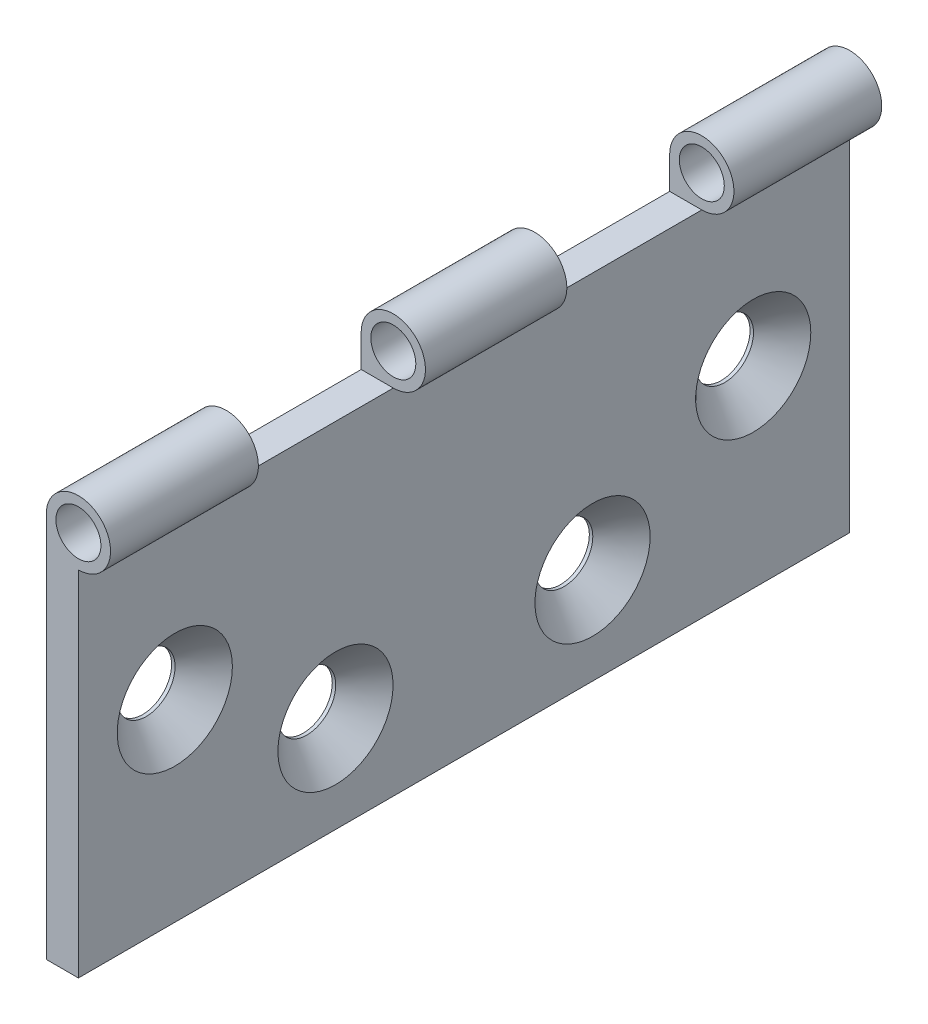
ISO-10303-21;
HEADER;
FILE_DESCRIPTION(('STEP AP214'),'2;1');
FILE_NAME('part.step','',(''),(''),'','','');
FILE_SCHEMA(('AUTOMOTIVE_DESIGN { 1 0 10303 214 1 1 1 1 }'));
ENDSEC;
DATA;
#1=APPLICATION_CONTEXT('core data for automotive mechanical design processes');
#2=APPLICATION_PROTOCOL_DEFINITION('international standard','automotive_design',2000,#1);
#3=PRODUCT_CONTEXT('',#1,'mechanical');
#4=PRODUCT('Part','Part','',(#3));
#5=PRODUCT_RELATED_PRODUCT_CATEGORY('part','',(#4));
#6=PRODUCT_DEFINITION_FORMATION('','',#4);
#7=PRODUCT_DEFINITION_CONTEXT('part definition',#1,'design');
#8=PRODUCT_DEFINITION('design','',#6,#7);
#9=PRODUCT_DEFINITION_SHAPE('','',#8);
#10=(LENGTH_UNIT() NAMED_UNIT(*) SI_UNIT(.MILLI.,.METRE.));
#11=(NAMED_UNIT(*) PLANE_ANGLE_UNIT() SI_UNIT($,.RADIAN.));
#12=(NAMED_UNIT(*) SI_UNIT($,.STERADIAN.) SOLID_ANGLE_UNIT());
#13=UNCERTAINTY_MEASURE_WITH_UNIT(LENGTH_MEASURE(1.E-05),#10,'distance_accuracy_value','');
#14=(GEOMETRIC_REPRESENTATION_CONTEXT(3) GLOBAL_UNCERTAINTY_ASSIGNED_CONTEXT((#13)) GLOBAL_UNIT_ASSIGNED_CONTEXT((#10,
#11,#12)) REPRESENTATION_CONTEXT('',''));
#15=CARTESIAN_POINT('',(0.,0.,0.));
#16=DIRECTION('',(0.,0.,1.));
#17=DIRECTION('',(1.,0.,0.));
#18=AXIS2_PLACEMENT_3D('',#15,#16,#17);
#19=CARTESIAN_POINT('',(0.,0.,60.));
#20=DIRECTION('',(-1.,0.,0.));
#21=DIRECTION('',(0.,-1.,0.));
#22=AXIS2_PLACEMENT_3D('',#19,#20,#21);
#23=PLANE('',#22);
#24=CARTESIAN_POINT('',(-3.13117587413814E-13,30.,-45.));
#25=DIRECTION('',(1.,0.,0.));
#26=DIRECTION('',(0.,0.,-1.));
#27=AXIS2_PLACEMENT_3D('',#24,#25,#26);
#28=CIRCLE('',#27,4.5);
#29=CARTESIAN_POINT('',(-3.13117587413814E-13,30.,-49.5));
#30=VERTEX_POINT('',#29);
#31=EDGE_CURVE('E159',#30,#30,#28,.T.);
#32=ORIENTED_EDGE('',*,*,#31,.T.);
#33=EDGE_LOOP('',(#32));
#34=FACE_BOUND('',#33,.T.);
#35=CARTESIAN_POINT('',(-2.60208521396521E-13,15.,-20.));
#36=DIRECTION('',(1.,0.,0.));
#37=DIRECTION('',(0.,0.,-1.));
#38=AXIS2_PLACEMENT_3D('',#35,#36,#37);
#39=CIRCLE('',#38,4.5);
#40=CARTESIAN_POINT('',(-2.60208521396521E-13,15.,-24.5));
#41=VERTEX_POINT('',#40);
#42=EDGE_CURVE('E168',#41,#41,#39,.T.);
#43=ORIENTED_EDGE('',*,*,#42,.T.);
#44=EDGE_LOOP('',(#43));
#45=FACE_BOUND('',#44,.T.);
#46=CARTESIAN_POINT('',(-3.13117587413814E-13,30.,45.));
#47=DIRECTION('',(1.,0.,0.));
#48=DIRECTION('',(0.,0.,-1.));
#49=AXIS2_PLACEMENT_3D('',#46,#47,#48);
#50=CIRCLE('',#49,4.5);
#51=CARTESIAN_POINT('',(-3.13117587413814E-13,30.,40.5));
#52=VERTEX_POINT('',#51);
#53=EDGE_CURVE('E177',#52,#52,#50,.T.);
#54=ORIENTED_EDGE('',*,*,#53,.T.);
#55=EDGE_LOOP('',(#54));
#56=FACE_BOUND('',#55,.T.);
#57=CARTESIAN_POINT('',(-2.60208521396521E-13,15.,20.));
#58=DIRECTION('',(1.,0.,0.));
#59=DIRECTION('',(0.,0.,-1.));
#60=AXIS2_PLACEMENT_3D('',#57,#58,#59);
#61=CIRCLE('',#60,4.5);
#62=CARTESIAN_POINT('',(-2.60208521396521E-13,15.,15.5));
#63=VERTEX_POINT('',#62);
#64=EDGE_CURVE('E186',#63,#63,#61,.T.);
#65=ORIENTED_EDGE('',*,*,#64,.T.);
#66=EDGE_LOOP('',(#65));
#67=FACE_BOUND('',#66,.T.);
#68=DIRECTION('',(0.,0.,1.));
#69=VECTOR('',#68,1.);
#70=CARTESIAN_POINT('',(-5.04804531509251E-13,55.,0.));
#71=LINE('',#70,#69);
#72=CARTESIAN_POINT('',(-5.04804531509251E-13,55.,-37.));
#73=VERTEX_POINT('',#72);
#74=CARTESIAN_POINT('',(-5.04804531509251E-13,55.,-11.));
#75=VERTEX_POINT('',#74);
#76=EDGE_CURVE('E244',#73,#75,#71,.T.);
#77=ORIENTED_EDGE('',*,*,#76,.F.);
#78=DIRECTION('',(0.,-1.,0.));
#79=VECTOR('',#78,1.);
#80=CARTESIAN_POINT('',(-3.12250225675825E-13,0.,-37.));
#81=LINE('',#80,#79);
#82=CARTESIAN_POINT('',(-5.21842550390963E-13,60.,-37.));
#83=VERTEX_POINT('',#82);
#84=EDGE_CURVE('E127',#83,#73,#81,.T.);
#85=ORIENTED_EDGE('',*,*,#84,.F.);
#86=DIRECTION('',(0.,0.,-1.));
#87=VECTOR('',#86,1.);
#88=CARTESIAN_POINT('',(-2.09419661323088E-13,60.,60.));
#89=LINE('',#88,#87);
#90=CARTESIAN_POINT('',(-2.09419661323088E-13,60.,-60.));
#91=VERTEX_POINT('',#90);
#92=EDGE_CURVE('E44',#83,#91,#89,.T.);
#93=ORIENTED_EDGE('',*,*,#92,.T.);
#94=DIRECTION('',(0.,1.,0.));
#95=VECTOR('',#94,1.);
#96=CARTESIAN_POINT('',(0.,0.,-60.));
#97=LINE('',#96,#95);
#98=CARTESIAN_POINT('',(0.,0.,-60.));
#99=VERTEX_POINT('',#98);
#100=EDGE_CURVE('E94',#99,#91,#97,.T.);
#101=ORIENTED_EDGE('',*,*,#100,.F.);
#102=DIRECTION('',(0.,0.,-1.));
#103=VECTOR('',#102,1.);
#104=CARTESIAN_POINT('',(0.,0.,60.));
#105=LINE('',#104,#103);
#106=CARTESIAN_POINT('',(0.,0.,60.));
#107=VERTEX_POINT('',#106);
#108=EDGE_CURVE('E83',#107,#99,#105,.T.);
#109=ORIENTED_EDGE('',*,*,#108,.F.);
#110=DIRECTION('',(0.,1.,0.));
#111=VECTOR('',#110,1.);
#112=CARTESIAN_POINT('',(0.,0.,60.));
#113=LINE('',#112,#111);
#114=CARTESIAN_POINT('',(-2.07299455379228E-13,60.,60.));
#115=VERTEX_POINT('',#114);
#116=EDGE_CURVE('E100',#107,#115,#113,.T.);
#117=ORIENTED_EDGE('',*,*,#116,.T.);
#118=CARTESIAN_POINT('',(-5.21842550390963E-13,60.,37.));
#119=VERTEX_POINT('',#118);
#120=EDGE_CURVE('E11',#115,#119,#89,.T.);
#121=ORIENTED_EDGE('',*,*,#120,.T.);
#122=DIRECTION('',(0.,-1.,0.));
#123=VECTOR('',#122,1.);
#124=CARTESIAN_POINT('',(-3.12250225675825E-13,0.,37.));
#125=LINE('',#124,#123);
#126=CARTESIAN_POINT('',(-5.04804531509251E-13,55.,37.));
#127=VERTEX_POINT('',#126);
#128=EDGE_CURVE('E138',#119,#127,#125,.T.);
#129=ORIENTED_EDGE('',*,*,#128,.T.);
#130=DIRECTION('',(0.,0.,1.));
#131=VECTOR('',#130,1.);
#132=CARTESIAN_POINT('',(-5.04804531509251E-13,55.,0.));
#133=LINE('',#132,#131);
#134=CARTESIAN_POINT('',(-5.04804531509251E-13,55.,11.));
#135=VERTEX_POINT('',#134);
#136=EDGE_CURVE('E141',#135,#127,#133,.T.);
#137=ORIENTED_EDGE('',*,*,#136,.F.);
#138=DIRECTION('',(0.,-1.,0.));
#139=VECTOR('',#138,1.);
#140=CARTESIAN_POINT('',(-3.12250225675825E-13,0.,11.));
#141=LINE('',#140,#139);
#142=CARTESIAN_POINT('',(-5.21842550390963E-13,60.,11.));
#143=VERTEX_POINT('',#142);
#144=EDGE_CURVE('E135',#143,#135,#141,.T.);
#145=ORIENTED_EDGE('',*,*,#144,.F.);
#146=CARTESIAN_POINT('',(-5.21842550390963E-13,60.,-11.));
#147=VERTEX_POINT('',#146);
#148=EDGE_CURVE('E42',#143,#147,#89,.T.);
#149=ORIENTED_EDGE('',*,*,#148,.T.);
#150=DIRECTION('',(0.,-1.,0.));
#151=VECTOR('',#150,1.);
#152=CARTESIAN_POINT('',(-3.12250225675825E-13,0.,-11.));
#153=LINE('',#152,#151);
#154=EDGE_CURVE('E250',#147,#75,#153,.T.);
#155=ORIENTED_EDGE('',*,*,#154,.T.);
#156=EDGE_LOOP('',(#77,#85,#93,#101,#109,#117,#121,#129,#137,#145,#149,#155));
#157=FACE_BOUND('',#156,.T.);
#158=ADVANCED_FACE('F33',(#34,#45,#56,#67,#157),#23,.T.);
#159=CARTESIAN_POINT('',(4.99999999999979,60.,-60.));
#160=DIRECTION('',(0.,0.,1.));
#161=DIRECTION('',(1.,0.,0.));
#162=AXIS2_PLACEMENT_3D('',#159,#160,#161);
#163=CYLINDRICAL_SURFACE('',#162,5.);
#164=CARTESIAN_POINT('',(4.99999999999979,60.,-37.));
#165=DIRECTION('',(0.,0.,1.));
#166=DIRECTION('',(1.,0.,0.));
#167=AXIS2_PLACEMENT_3D('',#164,#165,#166);
#168=CIRCLE('',#167,5.);
#169=CARTESIAN_POINT('',(4.99999999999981,55.,-37.));
#170=VERTEX_POINT('',#169);
#171=EDGE_CURVE('E132',#83,#170,#168,.F.);
#172=ORIENTED_EDGE('',*,*,#171,.T.);
#173=DIRECTION('',(0.,0.,1.));
#174=VECTOR('',#173,1.);
#175=CARTESIAN_POINT('',(4.99999999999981,55.,-60.));
#176=LINE('',#175,#174);
#177=CARTESIAN_POINT('',(4.99999999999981,55.,-60.));
#178=VERTEX_POINT('',#177);
#179=EDGE_CURVE('E95',#178,#170,#176,.T.);
#180=ORIENTED_EDGE('',*,*,#179,.F.);
#181=CARTESIAN_POINT('',(4.99999999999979,60.,-60.));
#182=DIRECTION('',(0.,0.,1.));
#183=DIRECTION('',(1.,0.,0.));
#184=AXIS2_PLACEMENT_3D('',#181,#182,#183);
#185=CIRCLE('',#184,5.);
#186=EDGE_CURVE('E93',#178,#91,#185,.T.);
#187=ORIENTED_EDGE('',*,*,#186,.T.);
#188=ORIENTED_EDGE('',*,*,#92,.F.);
#189=EDGE_LOOP('',(#172,#180,#187,#188));
#190=FACE_BOUND('',#189,.T.);
#191=ADVANCED_FACE('F261',(#190),#163,.T.);
#192=CARTESIAN_POINT('',(4.99999999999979,60.,-60.));
#193=DIRECTION('',(0.,0.,1.));
#194=DIRECTION('',(1.,0.,0.));
#195=AXIS2_PLACEMENT_3D('',#192,#193,#194);
#196=CYLINDRICAL_SURFACE('',#195,3.5);
#197=CARTESIAN_POINT('',(4.99999999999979,60.,-60.));
#198=DIRECTION('',(0.,0.,1.));
#199=DIRECTION('',(1.,0.,0.));
#200=AXIS2_PLACEMENT_3D('',#197,#198,#199);
#201=CIRCLE('',#200,3.5);
#202=CARTESIAN_POINT('',(8.49999999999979,60.,-60.));
#203=VERTEX_POINT('',#202);
#204=EDGE_CURVE('E190',#203,#203,#201,.T.);
#205=ORIENTED_EDGE('',*,*,#204,.F.);
#206=EDGE_LOOP('',(#205));
#207=FACE_BOUND('',#206,.T.);
#208=CARTESIAN_POINT('',(4.99999999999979,60.,-37.));
#209=DIRECTION('',(0.,0.,1.));
#210=DIRECTION('',(1.,0.,0.));
#211=AXIS2_PLACEMENT_3D('',#208,#209,#210);
#212=CIRCLE('',#211,3.5);
#213=CARTESIAN_POINT('',(8.49999999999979,60.,-37.));
#214=VERTEX_POINT('',#213);
#215=EDGE_CURVE('E37',#214,#214,#212,.F.);
#216=ORIENTED_EDGE('',*,*,#215,.F.);
#217=EDGE_LOOP('',(#216));
#218=FACE_BOUND('',#217,.T.);
#219=ADVANCED_FACE('F276',(#207,#218),#196,.F.);
#220=CARTESIAN_POINT('',(4.99999999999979,60.,-11.));
#221=DIRECTION('',(0.,0.,1.));
#222=DIRECTION('',(0.,-1.,0.));
#223=AXIS2_PLACEMENT_3D('',#220,#221,#222);
#224=CIRCLE('',#223,5.);
#225=CARTESIAN_POINT('',(4.99999999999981,55.,-11.));
#226=VERTEX_POINT('',#225);
#227=EDGE_CURVE('E51',#147,#226,#224,.F.);
#228=ORIENTED_EDGE('',*,*,#227,.F.);
#229=ORIENTED_EDGE('',*,*,#148,.F.);
#230=CARTESIAN_POINT('',(4.99999999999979,60.,11.));
#231=DIRECTION('',(0.,0.,1.));
#232=DIRECTION('',(0.,-1.,0.));
#233=AXIS2_PLACEMENT_3D('',#230,#231,#232);
#234=CIRCLE('',#233,5.);
#235=CARTESIAN_POINT('',(4.99999999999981,55.,11.));
#236=VERTEX_POINT('',#235);
#237=EDGE_CURVE('E112',#143,#236,#234,.F.);
#238=ORIENTED_EDGE('',*,*,#237,.T.);
#239=EDGE_CURVE('E201',#226,#236,#176,.T.);
#240=ORIENTED_EDGE('',*,*,#239,.F.);
#241=EDGE_LOOP('',(#228,#229,#238,#240));
#242=FACE_BOUND('',#241,.T.);
#243=ADVANCED_FACE('F273',(#242),#163,.T.);
#244=CARTESIAN_POINT('',(4.99999999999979,60.,-11.));
#245=DIRECTION('',(0.,0.,1.));
#246=DIRECTION('',(0.,-1.,0.));
#247=AXIS2_PLACEMENT_3D('',#244,#245,#246);
#248=CIRCLE('',#247,3.5);
#249=CARTESIAN_POINT('',(8.49999999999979,60.,-11.));
#250=VERTEX_POINT('',#249);
#251=EDGE_CURVE('E113',#250,#250,#248,.F.);
#252=CARTESIAN_POINT('',(4.99999999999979,60.,11.));
#253=DIRECTION('',(0.,0.,1.));
#254=DIRECTION('',(0.,-1.,0.));
#255=AXIS2_PLACEMENT_3D('',#252,#253,#254);
#256=CIRCLE('',#255,3.5);
#257=CARTESIAN_POINT('',(8.49999999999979,60.,11.));
#258=VERTEX_POINT('',#257);
#259=EDGE_CURVE('E110',#258,#258,#256,.F.);
#260=CARTESIAN_POINT('',(8.49999999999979,60.,-11.));
#261=CARTESIAN_POINT('',(8.49999999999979,60.,-10.7708333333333));
#262=CARTESIAN_POINT('',(8.49999999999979,60.,-10.5416666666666));
#263=CARTESIAN_POINT('',(8.49999999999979,60.,-10.0833333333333));
#264=CARTESIAN_POINT('',(8.49999999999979,60.,-9.85416666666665));
#265=CARTESIAN_POINT('',(8.49999999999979,60.,-9.39583333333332));
#266=CARTESIAN_POINT('',(8.49999999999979,60.,-9.16666666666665));
#267=CARTESIAN_POINT('',(8.49999999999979,60.,-8.70833333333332));
#268=CARTESIAN_POINT('',(8.49999999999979,60.,-8.47916666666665));
#269=CARTESIAN_POINT('',(8.49999999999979,60.,-8.02083333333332));
#270=CARTESIAN_POINT('',(8.49999999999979,60.,-7.79166666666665));
#271=CARTESIAN_POINT('',(8.49999999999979,60.,-7.33333333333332));
#272=CARTESIAN_POINT('',(8.49999999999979,60.,-7.10416666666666));
#273=CARTESIAN_POINT('',(8.49999999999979,60.,-6.64583333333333));
#274=CARTESIAN_POINT('',(8.49999999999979,60.,-6.41666666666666));
#275=CARTESIAN_POINT('',(8.49999999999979,60.,-5.95833333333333));
#276=CARTESIAN_POINT('',(8.49999999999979,60.,-5.72916666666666));
#277=CARTESIAN_POINT('',(8.49999999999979,60.,-5.27083333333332));
#278=CARTESIAN_POINT('',(8.49999999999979,60.,-5.04166666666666));
#279=CARTESIAN_POINT('',(8.49999999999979,60.,-4.58333333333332));
#280=CARTESIAN_POINT('',(8.49999999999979,60.,-4.35416666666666));
#281=CARTESIAN_POINT('',(8.49999999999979,60.,-3.89583333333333));
#282=CARTESIAN_POINT('',(8.49999999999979,60.,-3.66666666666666));
#283=CARTESIAN_POINT('',(8.49999999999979,60.,-3.20833333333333));
#284=CARTESIAN_POINT('',(8.49999999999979,60.,-2.97916666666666));
#285=CARTESIAN_POINT('',(8.49999999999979,60.,-2.52083333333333));
#286=CARTESIAN_POINT('',(8.49999999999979,60.,-2.29166666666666));
#287=CARTESIAN_POINT('',(8.49999999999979,60.,-1.83333333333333));
#288=CARTESIAN_POINT('',(8.49999999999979,60.,-1.60416666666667));
#289=CARTESIAN_POINT('',(8.49999999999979,60.,-1.14583333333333));
#290=CARTESIAN_POINT('',(8.49999999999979,60.,-0.916666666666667));
#291=CARTESIAN_POINT('',(8.49999999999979,60.,-0.458333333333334));
#292=CARTESIAN_POINT('',(8.49999999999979,60.,-0.229166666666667));
#293=CARTESIAN_POINT('',(8.49999999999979,60.,0.229166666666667));
#294=CARTESIAN_POINT('',(8.49999999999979,60.,0.458333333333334));
#295=CARTESIAN_POINT('',(8.49999999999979,60.,0.916666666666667));
#296=CARTESIAN_POINT('',(8.49999999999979,60.,1.14583333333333));
#297=CARTESIAN_POINT('',(8.49999999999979,60.,1.60416666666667));
#298=CARTESIAN_POINT('',(8.49999999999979,60.,1.83333333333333));
#299=CARTESIAN_POINT('',(8.49999999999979,60.,2.29166666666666));
#300=CARTESIAN_POINT('',(8.49999999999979,60.,2.52083333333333));
#301=CARTESIAN_POINT('',(8.49999999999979,60.,2.97916666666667));
#302=CARTESIAN_POINT('',(8.49999999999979,60.,3.20833333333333));
#303=CARTESIAN_POINT('',(8.49999999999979,60.,3.66666666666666));
#304=CARTESIAN_POINT('',(8.49999999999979,60.,3.89583333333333));
#305=CARTESIAN_POINT('',(8.49999999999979,60.,4.35416666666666));
#306=CARTESIAN_POINT('',(8.49999999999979,60.,4.58333333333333));
#307=CARTESIAN_POINT('',(8.49999999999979,60.,5.04166666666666));
#308=CARTESIAN_POINT('',(8.49999999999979,60.,5.27083333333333));
#309=CARTESIAN_POINT('',(8.49999999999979,60.,5.72916666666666));
#310=CARTESIAN_POINT('',(8.49999999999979,60.,5.95833333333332));
#311=CARTESIAN_POINT('',(8.49999999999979,60.,6.41666666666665));
#312=CARTESIAN_POINT('',(8.49999999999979,60.,6.64583333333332));
#313=CARTESIAN_POINT('',(8.49999999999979,60.,7.10416666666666));
#314=CARTESIAN_POINT('',(8.49999999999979,60.,7.33333333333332));
#315=CARTESIAN_POINT('',(8.49999999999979,60.,7.79166666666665));
#316=CARTESIAN_POINT('',(8.49999999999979,60.,8.02083333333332));
#317=CARTESIAN_POINT('',(8.49999999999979,60.,8.47916666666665));
#318=CARTESIAN_POINT('',(8.49999999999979,60.,8.70833333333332));
#319=CARTESIAN_POINT('',(8.49999999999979,60.,9.16666666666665));
#320=CARTESIAN_POINT('',(8.49999999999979,60.,9.39583333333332));
#321=CARTESIAN_POINT('',(8.49999999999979,60.,9.85416666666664));
#322=CARTESIAN_POINT('',(8.49999999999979,60.,10.0833333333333));
#323=CARTESIAN_POINT('',(8.49999999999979,60.,10.5416666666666));
#324=CARTESIAN_POINT('',(8.49999999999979,60.,10.7708333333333));
#325=CARTESIAN_POINT('',(8.49999999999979,60.,11.));
#326=B_SPLINE_CURVE_WITH_KNOTS('',3,(#260,#261,#262,#263,#264,#265,#266,#267,#268,#269,#270,
#271,#272,#273,#274,#275,#276,#277,#278,#279,#280,#281,#282,#283,#284,#285,#286,#287,#288,#289,
#290,#291,#292,#293,#294,#295,#296,#297,#298,#299,#300,#301,#302,#303,#304,#305,#306,#307,#308,
#309,#310,#311,#312,#313,#314,#315,#316,#317,#318,#319,#320,#321,#322,#323,#324,#325),
.UNSPECIFIED.,.F.,.F.,(4,2,2,2,2,2,2,2,2,2,2,2,2,2,2,2,2,2,2,2,2,2,2,2,2,2,2,2,2,2,2,2,4),(0.,
0.687500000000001,1.375,2.06249999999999,2.75,3.4375,4.12499999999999,4.81249999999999,
5.49999999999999,6.18749999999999,6.87499999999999,7.56249999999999,8.24999999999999,
8.93749999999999,9.62499999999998,10.3125,11.,11.6875,12.375,13.0625,13.75,14.4375,15.125,
15.8125,16.5,17.1875,17.875,18.5625,19.25,19.9375,20.625,21.3125,22.),.UNSPECIFIED.);
#327=EDGE_CURVE('BSEAM275',#250,#258,#326,.T.);
#328=ORIENTED_EDGE('',*,*,#251,.T.);
#329=ORIENTED_EDGE('',*,*,#259,.F.);
#330=ORIENTED_EDGE('',*,*,#327,.T.);
#331=ORIENTED_EDGE('',*,*,#327,.F.);
#332=EDGE_LOOP('',(#328,#330,#329,#331));
#333=FACE_BOUND('',#332,.T.);
#334=ADVANCED_FACE('F275',(#333),#196,.F.);
#335=CARTESIAN_POINT('',(5.,0.,60.));
#336=DIRECTION('',(-1.,0.,0.));
#337=DIRECTION('',(0.,-1.,0.));
#338=AXIS2_PLACEMENT_3D('',#335,#336,#337);
#339=PLANE('',#338);
#340=CARTESIAN_POINT('',(4.9999999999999,30.,-45.));
#341=DIRECTION('',(1.,0.,0.));
#342=DIRECTION('',(0.,0.,-1.));
#343=AXIS2_PLACEMENT_3D('',#340,#341,#342);
#344=CIRCLE('',#343,8.96);
#345=CARTESIAN_POINT('',(4.9999999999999,30.,-53.96));
#346=VERTEX_POINT('',#345);
#347=EDGE_CURVE('E153',#346,#346,#344,.T.);
#348=ORIENTED_EDGE('',*,*,#347,.F.);
#349=EDGE_LOOP('',(#348));
#350=FACE_BOUND('',#349,.T.);
#351=CARTESIAN_POINT('',(4.99999999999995,15.,-20.));
#352=DIRECTION('',(1.,0.,0.));
#353=DIRECTION('',(0.,0.,-1.));
#354=AXIS2_PLACEMENT_3D('',#351,#352,#353);
#355=CIRCLE('',#354,8.96);
#356=CARTESIAN_POINT('',(4.99999999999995,15.,-28.96));
#357=VERTEX_POINT('',#356);
#358=EDGE_CURVE('E162',#357,#357,#355,.T.);
#359=ORIENTED_EDGE('',*,*,#358,.F.);
#360=EDGE_LOOP('',(#359));
#361=FACE_BOUND('',#360,.T.);
#362=CARTESIAN_POINT('',(4.9999999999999,30.,45.));
#363=DIRECTION('',(1.,0.,0.));
#364=DIRECTION('',(0.,0.,-1.));
#365=AXIS2_PLACEMENT_3D('',#362,#363,#364);
#366=CIRCLE('',#365,8.96);
#367=CARTESIAN_POINT('',(4.9999999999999,30.,36.04));
#368=VERTEX_POINT('',#367);
#369=EDGE_CURVE('E171',#368,#368,#366,.T.);
#370=ORIENTED_EDGE('',*,*,#369,.F.);
#371=EDGE_LOOP('',(#370));
#372=FACE_BOUND('',#371,.T.);
#373=CARTESIAN_POINT('',(4.99999999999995,15.,20.));
#374=DIRECTION('',(1.,0.,0.));
#375=DIRECTION('',(0.,0.,-1.));
#376=AXIS2_PLACEMENT_3D('',#373,#374,#375);
#377=CIRCLE('',#376,8.96);
#378=CARTESIAN_POINT('',(4.99999999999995,15.,11.04));
#379=VERTEX_POINT('',#378);
#380=EDGE_CURVE('E180',#379,#379,#377,.T.);
#381=ORIENTED_EDGE('',*,*,#380,.F.);
#382=EDGE_LOOP('',(#381));
#383=FACE_BOUND('',#382,.T.);
#384=DIRECTION('',(0.,1.,0.));
#385=VECTOR('',#384,1.);
#386=CARTESIAN_POINT('',(5.,0.,-60.));
#387=LINE('',#386,#385);
#388=CARTESIAN_POINT('',(5.,0.,-60.));
#389=VERTEX_POINT('',#388);
#390=EDGE_CURVE('E78',#389,#178,#387,.T.);
#391=ORIENTED_EDGE('',*,*,#390,.T.);
#392=ORIENTED_EDGE('',*,*,#179,.T.);
#393=EDGE_CURVE('E200',#170,#226,#176,.T.);
#394=ORIENTED_EDGE('',*,*,#393,.T.);
#395=ORIENTED_EDGE('',*,*,#239,.T.);
#396=CARTESIAN_POINT('',(4.99999999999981,55.,37.));
#397=VERTEX_POINT('',#396);
#398=EDGE_CURVE('E202',#236,#397,#176,.T.);
#399=ORIENTED_EDGE('',*,*,#398,.T.);
#400=CARTESIAN_POINT('',(4.99999999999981,55.,60.));
#401=VERTEX_POINT('',#400);
#402=EDGE_CURVE('E197',#397,#401,#176,.T.);
#403=ORIENTED_EDGE('',*,*,#402,.T.);
#404=DIRECTION('',(0.,1.,0.));
#405=VECTOR('',#404,1.);
#406=CARTESIAN_POINT('',(5.,0.,60.));
#407=LINE('',#406,#405);
#408=CARTESIAN_POINT('',(5.,0.,60.));
#409=VERTEX_POINT('',#408);
#410=EDGE_CURVE('E81',#409,#401,#407,.T.);
#411=ORIENTED_EDGE('',*,*,#410,.F.);
#412=DIRECTION('',(0.,0.,-1.));
#413=VECTOR('',#412,1.);
#414=CARTESIAN_POINT('',(5.,0.,60.));
#415=LINE('',#414,#413);
#416=EDGE_CURVE('E60',#409,#389,#415,.T.);
#417=ORIENTED_EDGE('',*,*,#416,.T.);
#418=EDGE_LOOP('',(#391,#392,#394,#395,#399,#403,#411,#417));
#419=FACE_BOUND('',#418,.T.);
#420=ADVANCED_FACE('F35',(#350,#361,#372,#383,#419),#339,.F.);
#421=CARTESIAN_POINT('',(5.,0.,60.));
#422=DIRECTION('',(0.,-1.,0.));
#423=DIRECTION('',(1.,0.,0.));
#424=AXIS2_PLACEMENT_3D('',#421,#422,#423);
#425=PLANE('',#424);
#426=DIRECTION('',(-1.,0.,0.));
#427=VECTOR('',#426,1.);
#428=CARTESIAN_POINT('',(5.,0.,-60.));
#429=LINE('',#428,#427);
#430=EDGE_CURVE('E91',#389,#99,#429,.T.);
#431=ORIENTED_EDGE('',*,*,#430,.F.);
#432=ORIENTED_EDGE('',*,*,#416,.F.);
#433=DIRECTION('',(-1.,0.,0.));
#434=VECTOR('',#433,1.);
#435=CARTESIAN_POINT('',(5.,0.,60.));
#436=LINE('',#435,#434);
#437=EDGE_CURVE('E84',#409,#107,#436,.T.);
#438=ORIENTED_EDGE('',*,*,#437,.T.);
#439=ORIENTED_EDGE('',*,*,#108,.T.);
#440=EDGE_LOOP('',(#431,#432,#438,#439));
#441=FACE_BOUND('',#440,.T.);
#442=ADVANCED_FACE('F97',(#441),#425,.T.);
#443=CARTESIAN_POINT('',(0.,0.,60.));
#444=DIRECTION('',(0.,0.,-1.));
#445=DIRECTION('',(-1.,0.,0.));
#446=AXIS2_PLACEMENT_3D('',#443,#444,#445);
#447=PLANE('',#446);
#448=CARTESIAN_POINT('',(4.99999999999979,60.,60.));
#449=DIRECTION('',(0.,0.,1.));
#450=DIRECTION('',(1.,0.,0.));
#451=AXIS2_PLACEMENT_3D('',#448,#449,#450);
#452=CIRCLE('',#451,3.5);
#453=CARTESIAN_POINT('',(8.49999999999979,60.,60.));
#454=VERTEX_POINT('',#453);
#455=EDGE_CURVE('E189',#454,#454,#452,.T.);
#456=ORIENTED_EDGE('',*,*,#455,.F.);
#457=EDGE_LOOP('',(#456));
#458=FACE_BOUND('',#457,.T.);
#459=ORIENTED_EDGE('',*,*,#410,.T.);
#460=CARTESIAN_POINT('',(4.99999999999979,60.,60.));
#461=DIRECTION('',(0.,0.,1.));
#462=DIRECTION('',(1.,0.,0.));
#463=AXIS2_PLACEMENT_3D('',#460,#461,#462);
#464=CIRCLE('',#463,5.);
#465=EDGE_CURVE('E193',#401,#115,#464,.T.);
#466=ORIENTED_EDGE('',*,*,#465,.T.);
#467=ORIENTED_EDGE('',*,*,#116,.F.);
#468=ORIENTED_EDGE('',*,*,#437,.F.);
#469=EDGE_LOOP('',(#459,#466,#467,#468));
#470=FACE_BOUND('',#469,.T.);
#471=ADVANCED_FACE('F208',(#458,#470),#447,.F.);
#472=CARTESIAN_POINT('',(0.,0.,-60.));
#473=DIRECTION('',(0.,0.,-1.));
#474=DIRECTION('',(-1.,0.,0.));
#475=AXIS2_PLACEMENT_3D('',#472,#473,#474);
#476=PLANE('',#475);
#477=ORIENTED_EDGE('',*,*,#204,.T.);
#478=EDGE_LOOP('',(#477));
#479=FACE_BOUND('',#478,.T.);
#480=ORIENTED_EDGE('',*,*,#100,.T.);
#481=ORIENTED_EDGE('',*,*,#186,.F.);
#482=ORIENTED_EDGE('',*,*,#390,.F.);
#483=ORIENTED_EDGE('',*,*,#430,.T.);
#484=EDGE_LOOP('',(#480,#481,#482,#483));
#485=FACE_BOUND('',#484,.T.);
#486=ADVANCED_FACE('F90',(#479,#485),#476,.T.);
#487=CARTESIAN_POINT('',(4.99999999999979,60.,37.));
#488=DIRECTION('',(0.,0.,1.));
#489=DIRECTION('',(1.,0.,0.));
#490=AXIS2_PLACEMENT_3D('',#487,#488,#489);
#491=CIRCLE('',#490,5.);
#492=EDGE_CURVE('E108',#119,#397,#491,.F.);
#493=ORIENTED_EDGE('',*,*,#492,.F.);
#494=ORIENTED_EDGE('',*,*,#120,.F.);
#495=ORIENTED_EDGE('',*,*,#465,.F.);
#496=ORIENTED_EDGE('',*,*,#402,.F.);
#497=EDGE_LOOP('',(#493,#494,#495,#496));
#498=FACE_BOUND('',#497,.T.);
#499=ADVANCED_FACE('F278',(#498),#163,.T.);
#500=CARTESIAN_POINT('',(4.99999999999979,60.,37.));
#501=DIRECTION('',(0.,0.,1.));
#502=DIRECTION('',(1.,0.,0.));
#503=AXIS2_PLACEMENT_3D('',#500,#501,#502);
#504=CIRCLE('',#503,3.5);
#505=CARTESIAN_POINT('',(8.49999999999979,60.,37.));
#506=VERTEX_POINT('',#505);
#507=EDGE_CURVE('E105',#506,#506,#504,.F.);
#508=ORIENTED_EDGE('',*,*,#507,.T.);
#509=EDGE_LOOP('',(#508));
#510=FACE_BOUND('',#509,.T.);
#511=ORIENTED_EDGE('',*,*,#455,.T.);
#512=EDGE_LOOP('',(#511));
#513=FACE_BOUND('',#512,.T.);
#514=ADVANCED_FACE('F284',(#510,#513),#196,.F.);
#515=CARTESIAN_POINT('',(4.99999999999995,15.,20.));
#516=DIRECTION('',(1.,0.,0.));
#517=DIRECTION('',(0.,0.,-1.));
#518=AXIS2_PLACEMENT_3D('',#515,#516,#517);
#519=CYLINDRICAL_SURFACE('',#518,4.49999999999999);
#520=ORIENTED_EDGE('',*,*,#64,.F.);
#521=EDGE_LOOP('',(#520));
#522=FACE_BOUND('',#521,.T.);
#523=CARTESIAN_POINT('',(0.539999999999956,15.,20.));
#524=DIRECTION('',(1.,0.,0.));
#525=DIRECTION('',(0.,0.,-1.));
#526=AXIS2_PLACEMENT_3D('',#523,#524,#525);
#527=CIRCLE('',#526,4.49999999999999);
#528=CARTESIAN_POINT('',(0.539999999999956,15.,15.5));
#529=VERTEX_POINT('',#528);
#530=EDGE_CURVE('E183',#529,#529,#527,.T.);
#531=ORIENTED_EDGE('',*,*,#530,.T.);
#532=EDGE_LOOP('',(#531));
#533=FACE_BOUND('',#532,.T.);
#534=ADVANCED_FACE('F307',(#522,#533),#519,.F.);
#535=CARTESIAN_POINT('',(4.99999999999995,15.,20.));
#536=DIRECTION('',(1.,0.,0.));
#537=DIRECTION('',(0.,0.,-1.));
#538=AXIS2_PLACEMENT_3D('',#535,#536,#537);
#539=CONICAL_SURFACE('',#538,8.96,0.78539816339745);
#540=ORIENTED_EDGE('',*,*,#530,.F.);
#541=EDGE_LOOP('',(#540));
#542=FACE_BOUND('',#541,.T.);
#543=ORIENTED_EDGE('',*,*,#380,.T.);
#544=EDGE_LOOP('',(#543));
#545=FACE_BOUND('',#544,.T.);
#546=ADVANCED_FACE('F313',(#542,#545),#539,.F.);
#547=CARTESIAN_POINT('',(4.9999999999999,30.,45.));
#548=DIRECTION('',(1.,0.,0.));
#549=DIRECTION('',(0.,0.,-1.));
#550=AXIS2_PLACEMENT_3D('',#547,#548,#549);
#551=CYLINDRICAL_SURFACE('',#550,4.49999999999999);
#552=ORIENTED_EDGE('',*,*,#53,.F.);
#553=EDGE_LOOP('',(#552));
#554=FACE_BOUND('',#553,.T.);
#555=CARTESIAN_POINT('',(0.539999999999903,30.,45.));
#556=DIRECTION('',(1.,0.,0.));
#557=DIRECTION('',(0.,0.,-1.));
#558=AXIS2_PLACEMENT_3D('',#555,#556,#557);
#559=CIRCLE('',#558,4.49999999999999);
#560=CARTESIAN_POINT('',(0.539999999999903,30.,40.5));
#561=VERTEX_POINT('',#560);
#562=EDGE_CURVE('E174',#561,#561,#559,.T.);
#563=ORIENTED_EDGE('',*,*,#562,.T.);
#564=EDGE_LOOP('',(#563));
#565=FACE_BOUND('',#564,.T.);
#566=ADVANCED_FACE('F319',(#554,#565),#551,.F.);
#567=CARTESIAN_POINT('',(4.9999999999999,30.,45.));
#568=DIRECTION('',(1.,0.,0.));
#569=DIRECTION('',(0.,0.,-1.));
#570=AXIS2_PLACEMENT_3D('',#567,#568,#569);
#571=CONICAL_SURFACE('',#570,8.96,0.78539816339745);
#572=ORIENTED_EDGE('',*,*,#562,.F.);
#573=EDGE_LOOP('',(#572));
#574=FACE_BOUND('',#573,.T.);
#575=ORIENTED_EDGE('',*,*,#369,.T.);
#576=EDGE_LOOP('',(#575));
#577=FACE_BOUND('',#576,.T.);
#578=ADVANCED_FACE('F323',(#574,#577),#571,.F.);
#579=CARTESIAN_POINT('',(4.99999999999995,15.,-20.));
#580=DIRECTION('',(1.,0.,0.));
#581=DIRECTION('',(0.,0.,-1.));
#582=AXIS2_PLACEMENT_3D('',#579,#580,#581);
#583=CYLINDRICAL_SURFACE('',#582,4.49999999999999);
#584=ORIENTED_EDGE('',*,*,#42,.F.);
#585=EDGE_LOOP('',(#584));
#586=FACE_BOUND('',#585,.T.);
#587=CARTESIAN_POINT('',(0.539999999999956,15.,-20.));
#588=DIRECTION('',(1.,0.,0.));
#589=DIRECTION('',(0.,0.,-1.));
#590=AXIS2_PLACEMENT_3D('',#587,#588,#589);
#591=CIRCLE('',#590,4.49999999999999);
#592=CARTESIAN_POINT('',(0.539999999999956,15.,-24.5));
#593=VERTEX_POINT('',#592);
#594=EDGE_CURVE('E165',#593,#593,#591,.T.);
#595=ORIENTED_EDGE('',*,*,#594,.T.);
#596=EDGE_LOOP('',(#595));
#597=FACE_BOUND('',#596,.T.);
#598=ADVANCED_FACE('F327',(#586,#597),#583,.F.);
#599=CARTESIAN_POINT('',(4.99999999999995,15.,-20.));
#600=DIRECTION('',(1.,0.,0.));
#601=DIRECTION('',(0.,0.,-1.));
#602=AXIS2_PLACEMENT_3D('',#599,#600,#601);
#603=CONICAL_SURFACE('',#602,8.96,0.78539816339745);
#604=ORIENTED_EDGE('',*,*,#594,.F.);
#605=EDGE_LOOP('',(#604));
#606=FACE_BOUND('',#605,.T.);
#607=ORIENTED_EDGE('',*,*,#358,.T.);
#608=EDGE_LOOP('',(#607));
#609=FACE_BOUND('',#608,.T.);
#610=ADVANCED_FACE('F331',(#606,#609),#603,.F.);
#611=CARTESIAN_POINT('',(4.9999999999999,30.,-45.));
#612=DIRECTION('',(1.,0.,0.));
#613=DIRECTION('',(0.,0.,-1.));
#614=AXIS2_PLACEMENT_3D('',#611,#612,#613);
#615=CYLINDRICAL_SURFACE('',#614,4.49999999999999);
#616=ORIENTED_EDGE('',*,*,#31,.F.);
#617=EDGE_LOOP('',(#616));
#618=FACE_BOUND('',#617,.T.);
#619=CARTESIAN_POINT('',(0.539999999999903,30.,-45.));
#620=DIRECTION('',(1.,0.,0.));
#621=DIRECTION('',(0.,0.,-1.));
#622=AXIS2_PLACEMENT_3D('',#619,#620,#621);
#623=CIRCLE('',#622,4.49999999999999);
#624=CARTESIAN_POINT('',(0.539999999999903,30.,-49.5));
#625=VERTEX_POINT('',#624);
#626=EDGE_CURVE('E156',#625,#625,#623,.T.);
#627=ORIENTED_EDGE('',*,*,#626,.T.);
#628=EDGE_LOOP('',(#627));
#629=FACE_BOUND('',#628,.T.);
#630=ADVANCED_FACE('F335',(#618,#629),#615,.F.);
#631=CARTESIAN_POINT('',(4.9999999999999,30.,-45.));
#632=DIRECTION('',(1.,0.,0.));
#633=DIRECTION('',(0.,0.,-1.));
#634=AXIS2_PLACEMENT_3D('',#631,#632,#633);
#635=CONICAL_SURFACE('',#634,8.96,0.78539816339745);
#636=ORIENTED_EDGE('',*,*,#626,.F.);
#637=EDGE_LOOP('',(#636));
#638=FACE_BOUND('',#637,.T.);
#639=ORIENTED_EDGE('',*,*,#347,.T.);
#640=EDGE_LOOP('',(#639));
#641=FACE_BOUND('',#640,.T.);
#642=ADVANCED_FACE('F339',(#638,#641),#635,.F.);
#643=CARTESIAN_POINT('',(-5.04804531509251E-13,55.,0.));
#644=DIRECTION('',(0.,1.,0.));
#645=DIRECTION('',(-1.,0.,0.));
#646=AXIS2_PLACEMENT_3D('',#643,#644,#645);
#647=PLANE('',#646);
#648=ORIENTED_EDGE('',*,*,#398,.F.);
#649=DIRECTION('',(1.,0.,0.));
#650=VECTOR('',#649,1.);
#651=CARTESIAN_POINT('',(-5.04804531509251E-13,55.,11.));
#652=LINE('',#651,#650);
#653=EDGE_CURVE('E109',#135,#236,#652,.T.);
#654=ORIENTED_EDGE('',*,*,#653,.F.);
#655=ORIENTED_EDGE('',*,*,#136,.T.);
#656=DIRECTION('',(1.,0.,0.));
#657=VECTOR('',#656,1.);
#658=CARTESIAN_POINT('',(-5.04804531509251E-13,55.,37.));
#659=LINE('',#658,#657);
#660=EDGE_CURVE('E144',#127,#397,#659,.T.);
#661=ORIENTED_EDGE('',*,*,#660,.T.);
#662=EDGE_LOOP('',(#648,#654,#655,#661));
#663=FACE_BOUND('',#662,.T.);
#664=ADVANCED_FACE('F268',(#663),#647,.T.);
#665=CARTESIAN_POINT('',(-3.12250225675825E-13,0.,11.));
#666=DIRECTION('',(0.,0.,1.));
#667=DIRECTION('',(0.,-1.,0.));
#668=AXIS2_PLACEMENT_3D('',#665,#666,#667);
#669=PLANE('',#668);
#670=ORIENTED_EDGE('',*,*,#144,.T.);
#671=ORIENTED_EDGE('',*,*,#653,.T.);
#672=ORIENTED_EDGE('',*,*,#237,.F.);
#673=EDGE_LOOP('',(#670,#671,#672));
#674=FACE_BOUND('',#673,.T.);
#675=ORIENTED_EDGE('',*,*,#259,.T.);
#676=EDGE_LOOP('',(#675));
#677=FACE_BOUND('',#676,.T.);
#678=ADVANCED_FACE('F271',(#674,#677),#669,.T.);
#679=CARTESIAN_POINT('',(-3.12250225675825E-13,0.,37.));
#680=DIRECTION('',(0.,0.,1.));
#681=DIRECTION('',(1.,0.,0.));
#682=AXIS2_PLACEMENT_3D('',#679,#680,#681);
#683=PLANE('',#682);
#684=ORIENTED_EDGE('',*,*,#492,.T.);
#685=ORIENTED_EDGE('',*,*,#660,.F.);
#686=ORIENTED_EDGE('',*,*,#128,.F.);
#687=EDGE_LOOP('',(#684,#685,#686));
#688=FACE_BOUND('',#687,.T.);
#689=ORIENTED_EDGE('',*,*,#507,.F.);
#690=EDGE_LOOP('',(#689));
#691=FACE_BOUND('',#690,.T.);
#692=ADVANCED_FACE('F346',(#688,#691),#683,.F.);
#693=CARTESIAN_POINT('',(-3.12250225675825E-13,0.,-37.));
#694=DIRECTION('',(0.,0.,1.));
#695=DIRECTION('',(1.,0.,0.));
#696=AXIS2_PLACEMENT_3D('',#693,#694,#695);
#697=PLANE('',#696);
#698=ORIENTED_EDGE('',*,*,#171,.F.);
#699=ORIENTED_EDGE('',*,*,#84,.T.);
#700=DIRECTION('',(1.,0.,0.));
#701=VECTOR('',#700,1.);
#702=CARTESIAN_POINT('',(-5.04804531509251E-13,55.,-37.));
#703=LINE('',#702,#701);
#704=EDGE_CURVE('E115',#73,#170,#703,.T.);
#705=ORIENTED_EDGE('',*,*,#704,.T.);
#706=EDGE_LOOP('',(#698,#699,#705));
#707=FACE_BOUND('',#706,.T.);
#708=ORIENTED_EDGE('',*,*,#215,.T.);
#709=EDGE_LOOP('',(#708));
#710=FACE_BOUND('',#709,.T.);
#711=ADVANCED_FACE('F349',(#707,#710),#697,.T.);
#712=CARTESIAN_POINT('',(-3.12250225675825E-13,0.,-11.));
#713=DIRECTION('',(0.,0.,1.));
#714=DIRECTION('',(0.,-1.,0.));
#715=AXIS2_PLACEMENT_3D('',#712,#713,#714);
#716=PLANE('',#715);
#717=ORIENTED_EDGE('',*,*,#227,.T.);
#718=DIRECTION('',(1.,0.,0.));
#719=VECTOR('',#718,1.);
#720=CARTESIAN_POINT('',(-5.04804531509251E-13,55.,-11.));
#721=LINE('',#720,#719);
#722=EDGE_CURVE('E120',#75,#226,#721,.T.);
#723=ORIENTED_EDGE('',*,*,#722,.F.);
#724=ORIENTED_EDGE('',*,*,#154,.F.);
#725=EDGE_LOOP('',(#717,#723,#724));
#726=FACE_BOUND('',#725,.T.);
#727=ORIENTED_EDGE('',*,*,#251,.F.);
#728=EDGE_LOOP('',(#727));
#729=FACE_BOUND('',#728,.T.);
#730=ADVANCED_FACE('F251',(#726,#729),#716,.F.);
#731=CARTESIAN_POINT('',(-5.04804531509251E-13,55.,0.));
#732=DIRECTION('',(0.,1.,0.));
#733=DIRECTION('',(-1.,0.,0.));
#734=AXIS2_PLACEMENT_3D('',#731,#732,#733);
#735=PLANE('',#734);
#736=ORIENTED_EDGE('',*,*,#393,.F.);
#737=ORIENTED_EDGE('',*,*,#704,.F.);
#738=ORIENTED_EDGE('',*,*,#76,.T.);
#739=ORIENTED_EDGE('',*,*,#722,.T.);
#740=EDGE_LOOP('',(#736,#737,#738,#739));
#741=FACE_BOUND('',#740,.T.);
#742=ADVANCED_FACE('F246',(#741),#735,.T.);
#743=CLOSED_SHELL('',(#158,#191,#219,#243,#334,#420,#442,#471,#486,#499,#514,#534,#546,#566,
#578,#598,#610,#630,#642,#664,#678,#692,#711,#730,#742));
#744=MANIFOLD_SOLID_BREP('B2',#743);
#745=ADVANCED_BREP_SHAPE_REPRESENTATION('',(#18,#744),#14);
#746=SHAPE_DEFINITION_REPRESENTATION(#9,#745);
ENDSEC;
END-ISO-10303-21;
